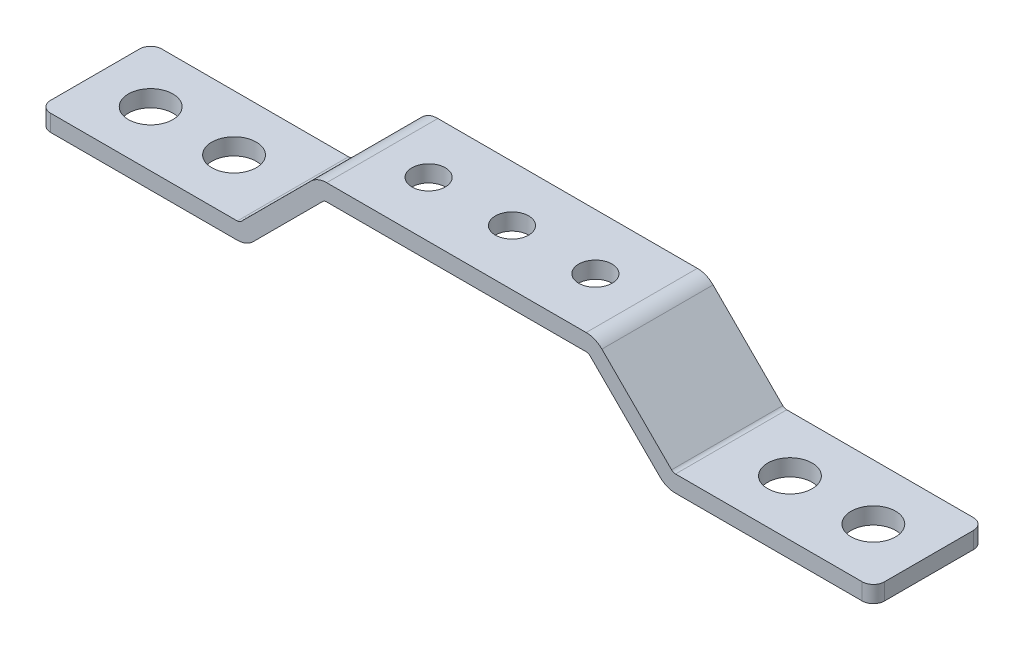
ISO-10303-21;
HEADER;
FILE_DESCRIPTION(('STEP AP214'),'2;1');
FILE_NAME('part.step','',(''),(''),'','','');
FILE_SCHEMA(('AUTOMOTIVE_DESIGN { 1 0 10303 214 1 1 1 1 }'));
ENDSEC;
DATA;
#1=APPLICATION_CONTEXT('core data for automotive mechanical design processes');
#2=APPLICATION_PROTOCOL_DEFINITION('international standard','automotive_design',2000,#1);
#3=PRODUCT_CONTEXT('',#1,'mechanical');
#4=PRODUCT('Part','Part','',(#3));
#5=PRODUCT_RELATED_PRODUCT_CATEGORY('part','',(#4));
#6=PRODUCT_DEFINITION_FORMATION('','',#4);
#7=PRODUCT_DEFINITION_CONTEXT('part definition',#1,'design');
#8=PRODUCT_DEFINITION('design','',#6,#7);
#9=PRODUCT_DEFINITION_SHAPE('','',#8);
#10=(LENGTH_UNIT() NAMED_UNIT(*) SI_UNIT(.MILLI.,.METRE.));
#11=(NAMED_UNIT(*) PLANE_ANGLE_UNIT() SI_UNIT($,.RADIAN.));
#12=(NAMED_UNIT(*) SI_UNIT($,.STERADIAN.) SOLID_ANGLE_UNIT());
#13=UNCERTAINTY_MEASURE_WITH_UNIT(LENGTH_MEASURE(1.E-05),#10,'distance_accuracy_value','');
#14=(GEOMETRIC_REPRESENTATION_CONTEXT(3) GLOBAL_UNCERTAINTY_ASSIGNED_CONTEXT((#13)) GLOBAL_UNIT_ASSIGNED_CONTEXT((#10,
#11,#12)) REPRESENTATION_CONTEXT('',''));
#15=CARTESIAN_POINT('',(0.,0.,0.));
#16=DIRECTION('',(0.,0.,1.));
#17=DIRECTION('',(1.,0.,0.));
#18=AXIS2_PLACEMENT_3D('',#15,#16,#17);
#19=CARTESIAN_POINT('',(39.4142135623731,-17.,10.));
#20=DIRECTION('',(0.,-1.,0.));
#21=DIRECTION('',(1.,0.,0.));
#22=AXIS2_PLACEMENT_3D('',#19,#20,#21);
#23=PLANE('',#22);
#24=CARTESIAN_POINT('',(65.,-17.,0.));
#25=DIRECTION('',(0.,1.,0.));
#26=DIRECTION('',(-1.,0.,0.));
#27=AXIS2_PLACEMENT_3D('',#24,#25,#26);
#28=CIRCLE('',#27,3.99999999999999);
#29=CARTESIAN_POINT('',(61.,-17.,0.));
#30=VERTEX_POINT('',#29);
#31=EDGE_CURVE('E654',#30,#30,#28,.T.);
#32=ORIENTED_EDGE('',*,*,#31,.T.);
#33=EDGE_LOOP('',(#32));
#34=FACE_BOUND('',#33,.T.);
#35=DIRECTION('',(0.,0.,-1.));
#36=VECTOR('',#35,1.);
#37=CARTESIAN_POINT('',(75.,-17.,10.));
#38=LINE('',#37,#36);
#39=CARTESIAN_POINT('',(75.,-17.,8.));
#40=VERTEX_POINT('',#39);
#41=CARTESIAN_POINT('',(75.,-17.,-8.));
#42=VERTEX_POINT('',#41);
#43=EDGE_CURVE('E332',#40,#42,#38,.T.);
#44=ORIENTED_EDGE('',*,*,#43,.F.);
#45=CARTESIAN_POINT('',(73.,-17.,8.));
#46=DIRECTION('',(0.,-1.,0.));
#47=DIRECTION('',(1.,0.,0.));
#48=AXIS2_PLACEMENT_3D('',#45,#46,#47);
#49=CIRCLE('',#48,2.);
#50=CARTESIAN_POINT('',(73.,-17.,10.));
#51=VERTEX_POINT('',#50);
#52=EDGE_CURVE('E11',#40,#51,#49,.T.);
#53=ORIENTED_EDGE('',*,*,#52,.T.);
#54=DIRECTION('',(-1.,0.,0.));
#55=VECTOR('',#54,1.);
#56=CARTESIAN_POINT('',(39.4142135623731,-17.,10.));
#57=LINE('',#56,#55);
#58=CARTESIAN_POINT('',(39.4142135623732,-17.,10.));
#59=VERTEX_POINT('',#58);
#60=EDGE_CURVE('E285',#51,#59,#57,.T.);
#61=ORIENTED_EDGE('',*,*,#60,.T.);
#62=DIRECTION('',(0.,0.,-1.));
#63=VECTOR('',#62,1.);
#64=CARTESIAN_POINT('',(39.4142135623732,-17.,10.));
#65=LINE('',#64,#63);
#66=CARTESIAN_POINT('',(39.4142135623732,-17.,-10.));
#67=VERTEX_POINT('',#66);
#68=EDGE_CURVE('E329',#59,#67,#65,.T.);
#69=ORIENTED_EDGE('',*,*,#68,.T.);
#70=DIRECTION('',(-1.,0.,0.));
#71=VECTOR('',#70,1.);
#72=CARTESIAN_POINT('',(39.4142135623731,-17.,-10.));
#73=LINE('',#72,#71);
#74=CARTESIAN_POINT('',(73.,-17.,-10.));
#75=VERTEX_POINT('',#74);
#76=EDGE_CURVE('E243',#75,#67,#73,.T.);
#77=ORIENTED_EDGE('',*,*,#76,.F.);
#78=CARTESIAN_POINT('',(73.,-17.,-8.));
#79=DIRECTION('',(0.,-1.,0.));
#80=DIRECTION('',(1.,0.,0.));
#81=AXIS2_PLACEMENT_3D('',#78,#79,#80);
#82=CIRCLE('',#81,2.);
#83=EDGE_CURVE('E41',#75,#42,#82,.T.);
#84=ORIENTED_EDGE('',*,*,#83,.T.);
#85=EDGE_LOOP('',(#44,#53,#61,#69,#77,#84));
#86=FACE_BOUND('',#85,.T.);
#87=CARTESIAN_POINT('',(50.,-17.,0.));
#88=DIRECTION('',(0.,-1.,0.));
#89=DIRECTION('',(1.,0.,0.));
#90=AXIS2_PLACEMENT_3D('',#87,#88,#89);
#91=CIRCLE('',#90,4.);
#92=CARTESIAN_POINT('',(46.,-17.,0.));
#93=VERTEX_POINT('',#92);
#94=EDGE_CURVE('E664',#93,#93,#91,.T.);
#95=ORIENTED_EDGE('',*,*,#94,.F.);
#96=EDGE_LOOP('',(#95));
#97=FACE_BOUND('',#96,.T.);
#98=ADVANCED_FACE('F33',(#34,#86,#97),#23,.T.);
#99=CARTESIAN_POINT('',(39.4142135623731,-14.,10.));
#100=DIRECTION('',(0.,-1.,0.));
#101=DIRECTION('',(1.,0.,0.));
#102=AXIS2_PLACEMENT_3D('',#99,#100,#101);
#103=PLANE('',#102);
#104=CARTESIAN_POINT('',(65.,-13.9999999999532,0.));
#105=DIRECTION('',(0.,1.,0.));
#106=DIRECTION('',(-1.,0.,0.));
#107=AXIS2_PLACEMENT_3D('',#104,#105,#106);
#108=CIRCLE('',#107,3.99999999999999);
#109=CARTESIAN_POINT('',(61.,-13.9999999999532,0.));
#110=VERTEX_POINT('',#109);
#111=EDGE_CURVE('E657',#110,#110,#108,.T.);
#112=ORIENTED_EDGE('',*,*,#111,.F.);
#113=EDGE_LOOP('',(#112));
#114=FACE_BOUND('',#113,.T.);
#115=DIRECTION('',(-1.,0.,0.));
#116=VECTOR('',#115,1.);
#117=CARTESIAN_POINT('',(39.4142135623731,-14.,10.));
#118=LINE('',#117,#116);
#119=CARTESIAN_POINT('',(73.,-14.,10.));
#120=VERTEX_POINT('',#119);
#121=CARTESIAN_POINT('',(39.4142135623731,-14.,10.));
#122=VERTEX_POINT('',#121);
#123=EDGE_CURVE('E283',#120,#122,#118,.T.);
#124=ORIENTED_EDGE('',*,*,#123,.F.);
#125=CARTESIAN_POINT('',(73.,-14.,8.));
#126=DIRECTION('',(0.,-1.,0.));
#127=DIRECTION('',(1.,0.,0.));
#128=AXIS2_PLACEMENT_3D('',#125,#126,#127);
#129=CIRCLE('',#128,2.);
#130=CARTESIAN_POINT('',(75.,-14.,8.));
#131=VERTEX_POINT('',#130);
#132=EDGE_CURVE('E380',#120,#131,#129,.F.);
#133=ORIENTED_EDGE('',*,*,#132,.T.);
#134=DIRECTION('',(0.,0.,-1.));
#135=VECTOR('',#134,1.);
#136=CARTESIAN_POINT('',(75.,-14.,10.));
#137=LINE('',#136,#135);
#138=CARTESIAN_POINT('',(75.,-14.,-8.));
#139=VERTEX_POINT('',#138);
#140=EDGE_CURVE('E334',#131,#139,#137,.T.);
#141=ORIENTED_EDGE('',*,*,#140,.T.);
#142=CARTESIAN_POINT('',(73.,-14.,-8.));
#143=DIRECTION('',(0.,-1.,0.));
#144=DIRECTION('',(1.,0.,0.));
#145=AXIS2_PLACEMENT_3D('',#142,#143,#144);
#146=CIRCLE('',#145,2.);
#147=CARTESIAN_POINT('',(73.,-14.,-10.));
#148=VERTEX_POINT('',#147);
#149=EDGE_CURVE('E378',#139,#148,#146,.F.);
#150=ORIENTED_EDGE('',*,*,#149,.T.);
#151=DIRECTION('',(-1.,0.,0.));
#152=VECTOR('',#151,1.);
#153=CARTESIAN_POINT('',(39.4142135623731,-14.,-10.));
#154=LINE('',#153,#152);
#155=CARTESIAN_POINT('',(39.4142135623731,-14.,-10.));
#156=VERTEX_POINT('',#155);
#157=EDGE_CURVE('E241',#148,#156,#154,.T.);
#158=ORIENTED_EDGE('',*,*,#157,.T.);
#159=DIRECTION('',(0.,0.,-1.));
#160=VECTOR('',#159,1.);
#161=CARTESIAN_POINT('',(39.4142135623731,-14.,10.));
#162=LINE('',#161,#160);
#163=EDGE_CURVE('E337',#122,#156,#162,.T.);
#164=ORIENTED_EDGE('',*,*,#163,.F.);
#165=EDGE_LOOP('',(#124,#133,#141,#150,#158,#164));
#166=FACE_BOUND('',#165,.T.);
#167=CARTESIAN_POINT('',(50.,-13.9999999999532,0.));
#168=DIRECTION('',(0.,-1.,0.));
#169=DIRECTION('',(1.,0.,0.));
#170=AXIS2_PLACEMENT_3D('',#167,#168,#169);
#171=CIRCLE('',#170,4.);
#172=CARTESIAN_POINT('',(46.,-13.9999999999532,0.));
#173=VERTEX_POINT('',#172);
#174=EDGE_CURVE('E659',#173,#173,#171,.T.);
#175=ORIENTED_EDGE('',*,*,#174,.T.);
#176=EDGE_LOOP('',(#175));
#177=FACE_BOUND('',#176,.T.);
#178=ADVANCED_FACE('F390',(#114,#166,#177),#103,.F.);
#179=CARTESIAN_POINT('',(-39.4142135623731,-17.,10.));
#180=DIRECTION('',(0.,-1.,0.));
#181=DIRECTION('',(1.,0.,0.));
#182=AXIS2_PLACEMENT_3D('',#179,#180,#181);
#183=PLANE('',#182);
#184=DIRECTION('',(-1.,0.,0.));
#185=VECTOR('',#184,1.);
#186=CARTESIAN_POINT('',(-39.4142135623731,-17.,10.));
#187=LINE('',#186,#185);
#188=CARTESIAN_POINT('',(-39.4142135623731,-17.,10.));
#189=VERTEX_POINT('',#188);
#190=CARTESIAN_POINT('',(-73.,-17.,10.));
#191=VERTEX_POINT('',#190);
#192=EDGE_CURVE('E308',#189,#191,#187,.T.);
#193=ORIENTED_EDGE('',*,*,#192,.T.);
#194=CARTESIAN_POINT('',(-73.,-17.,8.));
#195=DIRECTION('',(0.,-1.,0.));
#196=DIRECTION('',(1.,0.,0.));
#197=AXIS2_PLACEMENT_3D('',#194,#195,#196);
#198=CIRCLE('',#197,2.);
#199=CARTESIAN_POINT('',(-75.,-17.,8.));
#200=VERTEX_POINT('',#199);
#201=EDGE_CURVE('E373',#191,#200,#198,.T.);
#202=ORIENTED_EDGE('',*,*,#201,.T.);
#203=DIRECTION('',(0.,0.,-1.));
#204=VECTOR('',#203,1.);
#205=CARTESIAN_POINT('',(-75.,-17.,10.));
#206=LINE('',#205,#204);
#207=CARTESIAN_POINT('',(-75.,-17.,-8.));
#208=VERTEX_POINT('',#207);
#209=EDGE_CURVE('E311',#200,#208,#206,.T.);
#210=ORIENTED_EDGE('',*,*,#209,.T.);
#211=CARTESIAN_POINT('',(-73.,-17.,-8.));
#212=DIRECTION('',(0.,-1.,0.));
#213=DIRECTION('',(1.,0.,0.));
#214=AXIS2_PLACEMENT_3D('',#211,#212,#213);
#215=CIRCLE('',#214,2.);
#216=CARTESIAN_POINT('',(-73.,-17.,-10.));
#217=VERTEX_POINT('',#216);
#218=EDGE_CURVE('E371',#208,#217,#215,.T.);
#219=ORIENTED_EDGE('',*,*,#218,.T.);
#220=DIRECTION('',(-1.,0.,0.));
#221=VECTOR('',#220,1.);
#222=CARTESIAN_POINT('',(-39.4142135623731,-17.,-10.));
#223=LINE('',#222,#221);
#224=CARTESIAN_POINT('',(-39.4142135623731,-17.,-10.));
#225=VERTEX_POINT('',#224);
#226=EDGE_CURVE('E266',#225,#217,#223,.T.);
#227=ORIENTED_EDGE('',*,*,#226,.F.);
#228=DIRECTION('',(0.,0.,-1.));
#229=VECTOR('',#228,1.);
#230=CARTESIAN_POINT('',(-39.4142135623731,-17.,10.));
#231=LINE('',#230,#229);
#232=EDGE_CURVE('E315',#189,#225,#231,.T.);
#233=ORIENTED_EDGE('',*,*,#232,.F.);
#234=EDGE_LOOP('',(#193,#202,#210,#219,#227,#233));
#235=FACE_BOUND('',#234,.T.);
#236=CARTESIAN_POINT('',(-50.,-17.,0.));
#237=DIRECTION('',(0.,1.,0.));
#238=DIRECTION('',(-1.,0.,0.));
#239=AXIS2_PLACEMENT_3D('',#236,#237,#238);
#240=CIRCLE('',#239,4.);
#241=CARTESIAN_POINT('',(-54.,-17.,0.));
#242=VERTEX_POINT('',#241);
#243=EDGE_CURVE('E551',#242,#242,#240,.T.);
#244=ORIENTED_EDGE('',*,*,#243,.T.);
#245=EDGE_LOOP('',(#244));
#246=FACE_BOUND('',#245,.T.);
#247=CARTESIAN_POINT('',(-65.,-17.,0.));
#248=DIRECTION('',(0.,-1.,0.));
#249=DIRECTION('',(1.,0.,0.));
#250=AXIS2_PLACEMENT_3D('',#247,#248,#249);
#251=CIRCLE('',#250,3.99999999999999);
#252=CARTESIAN_POINT('',(-69.,-17.,0.));
#253=VERTEX_POINT('',#252);
#254=EDGE_CURVE('E670',#253,#253,#251,.T.);
#255=ORIENTED_EDGE('',*,*,#254,.F.);
#256=EDGE_LOOP('',(#255));
#257=FACE_BOUND('',#256,.T.);
#258=ADVANCED_FACE('F429',(#235,#246,#257),#183,.T.);
#259=CARTESIAN_POINT('',(-39.4142135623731,-14.,10.));
#260=DIRECTION('',(0.,-1.,0.));
#261=DIRECTION('',(1.,0.,0.));
#262=AXIS2_PLACEMENT_3D('',#259,#260,#261);
#263=PLANE('',#262);
#264=DIRECTION('',(0.,0.,-1.));
#265=VECTOR('',#264,1.);
#266=CARTESIAN_POINT('',(-75.,-14.,10.));
#267=LINE('',#266,#265);
#268=CARTESIAN_POINT('',(-75.,-14.,8.));
#269=VERTEX_POINT('',#268);
#270=CARTESIAN_POINT('',(-75.,-14.,-8.));
#271=VERTEX_POINT('',#270);
#272=EDGE_CURVE('E216',#269,#271,#267,.T.);
#273=ORIENTED_EDGE('',*,*,#272,.F.);
#274=CARTESIAN_POINT('',(-73.,-14.,8.));
#275=DIRECTION('',(0.,-1.,0.));
#276=DIRECTION('',(1.,0.,0.));
#277=AXIS2_PLACEMENT_3D('',#274,#275,#276);
#278=CIRCLE('',#277,2.);
#279=CARTESIAN_POINT('',(-73.,-14.,10.));
#280=VERTEX_POINT('',#279);
#281=EDGE_CURVE('E364',#269,#280,#278,.F.);
#282=ORIENTED_EDGE('',*,*,#281,.T.);
#283=DIRECTION('',(-1.,0.,0.));
#284=VECTOR('',#283,1.);
#285=CARTESIAN_POINT('',(-39.4142135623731,-14.,10.));
#286=LINE('',#285,#284);
#287=CARTESIAN_POINT('',(-39.4142135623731,-14.,10.));
#288=VERTEX_POINT('',#287);
#289=EDGE_CURVE('E215',#288,#280,#286,.T.);
#290=ORIENTED_EDGE('',*,*,#289,.F.);
#291=DIRECTION('',(0.,0.,-1.));
#292=VECTOR('',#291,1.);
#293=CARTESIAN_POINT('',(-39.4142135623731,-14.,10.));
#294=LINE('',#293,#292);
#295=CARTESIAN_POINT('',(-39.4142135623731,-14.,-10.));
#296=VERTEX_POINT('',#295);
#297=EDGE_CURVE('E199',#288,#296,#294,.T.);
#298=ORIENTED_EDGE('',*,*,#297,.T.);
#299=DIRECTION('',(-1.,0.,0.));
#300=VECTOR('',#299,1.);
#301=CARTESIAN_POINT('',(-39.4142135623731,-14.,-10.));
#302=LINE('',#301,#300);
#303=CARTESIAN_POINT('',(-73.,-14.,-10.));
#304=VERTEX_POINT('',#303);
#305=EDGE_CURVE('E207',#296,#304,#302,.T.);
#306=ORIENTED_EDGE('',*,*,#305,.T.);
#307=CARTESIAN_POINT('',(-73.,-14.,-8.));
#308=DIRECTION('',(0.,-1.,0.));
#309=DIRECTION('',(1.,0.,0.));
#310=AXIS2_PLACEMENT_3D('',#307,#308,#309);
#311=CIRCLE('',#310,2.);
#312=EDGE_CURVE('E362',#304,#271,#311,.F.);
#313=ORIENTED_EDGE('',*,*,#312,.T.);
#314=EDGE_LOOP('',(#273,#282,#290,#298,#306,#313));
#315=FACE_BOUND('',#314,.T.);
#316=CARTESIAN_POINT('',(-50.,-13.9999999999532,0.));
#317=DIRECTION('',(0.,1.,0.));
#318=DIRECTION('',(-1.,0.,0.));
#319=AXIS2_PLACEMENT_3D('',#316,#317,#318);
#320=CIRCLE('',#319,4.);
#321=CARTESIAN_POINT('',(-54.,-13.9999999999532,0.));
#322=VERTEX_POINT('',#321);
#323=EDGE_CURVE('E556',#322,#322,#320,.T.);
#324=ORIENTED_EDGE('',*,*,#323,.F.);
#325=EDGE_LOOP('',(#324));
#326=FACE_BOUND('',#325,.T.);
#327=CARTESIAN_POINT('',(-65.,-13.9999999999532,0.));
#328=DIRECTION('',(0.,-1.,0.));
#329=DIRECTION('',(1.,0.,0.));
#330=AXIS2_PLACEMENT_3D('',#327,#328,#329);
#331=CIRCLE('',#330,3.99999999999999);
#332=CARTESIAN_POINT('',(-69.,-13.9999999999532,0.));
#333=VERTEX_POINT('',#332);
#334=EDGE_CURVE('E667',#333,#333,#331,.T.);
#335=ORIENTED_EDGE('',*,*,#334,.T.);
#336=EDGE_LOOP('',(#335));
#337=FACE_BOUND('',#336,.T.);
#338=ADVANCED_FACE('F212',(#315,#326,#337),#263,.F.);
#339=CARTESIAN_POINT('',(-23.3431457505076,-3.,10.));
#340=DIRECTION('',(0.,-1.,0.));
#341=DIRECTION('',(0.,0.,-1.));
#342=AXIS2_PLACEMENT_3D('',#339,#340,#341);
#343=PLANE('',#342);
#344=DIRECTION('',(1.,0.,0.));
#345=VECTOR('',#344,1.);
#346=CARTESIAN_POINT('',(-23.3431457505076,-3.,-10.));
#347=LINE('',#346,#345);
#348=CARTESIAN_POINT('',(23.3431457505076,-3.,-10.));
#349=VERTEX_POINT('',#348);
#350=CARTESIAN_POINT('',(-23.3431457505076,-3.,-10.));
#351=VERTEX_POINT('',#350);
#352=EDGE_CURVE('E254',#349,#351,#347,.F.);
#353=ORIENTED_EDGE('',*,*,#352,.F.);
#354=DIRECTION('',(0.,0.,-1.));
#355=VECTOR('',#354,1.);
#356=CARTESIAN_POINT('',(23.3431457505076,-3.,10.));
#357=LINE('',#356,#355);
#358=CARTESIAN_POINT('',(23.3431457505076,-3.,10.));
#359=VERTEX_POINT('',#358);
#360=EDGE_CURVE('E323',#359,#349,#357,.T.);
#361=ORIENTED_EDGE('',*,*,#360,.F.);
#362=DIRECTION('',(1.,0.,0.));
#363=VECTOR('',#362,1.);
#364=CARTESIAN_POINT('',(-23.3431457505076,-3.,10.));
#365=LINE('',#364,#363);
#366=CARTESIAN_POINT('',(-23.3431457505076,-3.,10.));
#367=VERTEX_POINT('',#366);
#368=EDGE_CURVE('E296',#359,#367,#365,.F.);
#369=ORIENTED_EDGE('',*,*,#368,.T.);
#370=DIRECTION('',(0.,0.,-1.));
#371=VECTOR('',#370,1.);
#372=CARTESIAN_POINT('',(-23.3431457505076,-3.,10.));
#373=LINE('',#372,#371);
#374=EDGE_CURVE('E321',#367,#351,#373,.T.);
#375=ORIENTED_EDGE('',*,*,#374,.T.);
#376=EDGE_LOOP('',(#353,#361,#369,#375));
#377=FACE_BOUND('',#376,.T.);
#378=CARTESIAN_POINT('',(0.,-3.,0.));
#379=DIRECTION('',(0.,-1.,0.));
#380=DIRECTION('',(0.,0.,-1.));
#381=AXIS2_PLACEMENT_3D('',#378,#379,#380);
#382=CIRCLE('',#381,3.);
#383=CARTESIAN_POINT('',(0.,-3.,-3.));
#384=VERTEX_POINT('',#383);
#385=EDGE_CURVE('E223',#384,#384,#382,.T.);
#386=ORIENTED_EDGE('',*,*,#385,.F.);
#387=EDGE_LOOP('',(#386));
#388=FACE_BOUND('',#387,.T.);
#389=CARTESIAN_POINT('',(15.,-3.,0.));
#390=DIRECTION('',(0.,-1.,0.));
#391=DIRECTION('',(0.,0.,-1.));
#392=AXIS2_PLACEMENT_3D('',#389,#390,#391);
#393=CIRCLE('',#392,3.);
#394=CARTESIAN_POINT('',(15.,-3.,-3.));
#395=VERTEX_POINT('',#394);
#396=EDGE_CURVE('E561',#395,#395,#393,.T.);
#397=ORIENTED_EDGE('',*,*,#396,.F.);
#398=EDGE_LOOP('',(#397));
#399=FACE_BOUND('',#398,.T.);
#400=CARTESIAN_POINT('',(-15.,-3.,0.));
#401=DIRECTION('',(0.,-1.,0.));
#402=DIRECTION('',(0.,0.,-1.));
#403=AXIS2_PLACEMENT_3D('',#400,#401,#402);
#404=CIRCLE('',#403,3.);
#405=CARTESIAN_POINT('',(-15.,-3.,-3.));
#406=VERTEX_POINT('',#405);
#407=EDGE_CURVE('E550',#406,#406,#404,.F.);
#408=ORIENTED_EDGE('',*,*,#407,.T.);
#409=EDGE_LOOP('',(#408));
#410=FACE_BOUND('',#409,.T.);
#411=ADVANCED_FACE('F454',(#377,#388,#399,#410),#343,.T.);
#412=CARTESIAN_POINT('',(-23.3431457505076,0.,10.));
#413=DIRECTION('',(0.,-1.,0.));
#414=DIRECTION('',(0.,0.,-1.));
#415=AXIS2_PLACEMENT_3D('',#412,#413,#414);
#416=PLANE('',#415);
#417=DIRECTION('',(-1.,0.,0.));
#418=VECTOR('',#417,1.);
#419=CARTESIAN_POINT('',(-23.3431457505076,0.,-10.));
#420=LINE('',#419,#418);
#421=CARTESIAN_POINT('',(23.3431457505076,0.,-10.));
#422=VERTEX_POINT('',#421);
#423=CARTESIAN_POINT('',(-23.3431457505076,0.,-10.));
#424=VERTEX_POINT('',#423);
#425=EDGE_CURVE('E233',#422,#424,#420,.T.);
#426=ORIENTED_EDGE('',*,*,#425,.T.);
#427=DIRECTION('',(0.,0.,-1.));
#428=VECTOR('',#427,1.);
#429=CARTESIAN_POINT('',(-23.3431457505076,0.,10.));
#430=LINE('',#429,#428);
#431=CARTESIAN_POINT('',(-23.3431457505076,0.,10.));
#432=VERTEX_POINT('',#431);
#433=EDGE_CURVE('E349',#432,#424,#430,.T.);
#434=ORIENTED_EDGE('',*,*,#433,.F.);
#435=DIRECTION('',(-1.,0.,0.));
#436=VECTOR('',#435,1.);
#437=CARTESIAN_POINT('',(-23.3431457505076,0.,10.));
#438=LINE('',#437,#436);
#439=CARTESIAN_POINT('',(23.3431457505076,0.,10.));
#440=VERTEX_POINT('',#439);
#441=EDGE_CURVE('E275',#440,#432,#438,.T.);
#442=ORIENTED_EDGE('',*,*,#441,.F.);
#443=DIRECTION('',(0.,0.,-1.));
#444=VECTOR('',#443,1.);
#445=CARTESIAN_POINT('',(23.3431457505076,0.,10.));
#446=LINE('',#445,#444);
#447=EDGE_CURVE('E346',#440,#422,#446,.T.);
#448=ORIENTED_EDGE('',*,*,#447,.T.);
#449=EDGE_LOOP('',(#426,#434,#442,#448));
#450=FACE_BOUND('',#449,.T.);
#451=CARTESIAN_POINT('',(0.,0.,0.));
#452=DIRECTION('',(0.,1.,0.));
#453=DIRECTION('',(0.,0.,1.));
#454=AXIS2_PLACEMENT_3D('',#451,#452,#453);
#455=CIRCLE('',#454,3.);
#456=CARTESIAN_POINT('',(0.,0.,3.));
#457=VERTEX_POINT('',#456);
#458=EDGE_CURVE('E226',#457,#457,#455,.T.);
#459=ORIENTED_EDGE('',*,*,#458,.F.);
#460=EDGE_LOOP('',(#459));
#461=FACE_BOUND('',#460,.T.);
#462=CARTESIAN_POINT('',(15.,0.,0.));
#463=DIRECTION('',(0.,1.,0.));
#464=DIRECTION('',(0.,0.,1.));
#465=AXIS2_PLACEMENT_3D('',#462,#463,#464);
#466=CIRCLE('',#465,3.);
#467=CARTESIAN_POINT('',(15.,0.,3.));
#468=VERTEX_POINT('',#467);
#469=EDGE_CURVE('E545',#468,#468,#466,.T.);
#470=ORIENTED_EDGE('',*,*,#469,.F.);
#471=EDGE_LOOP('',(#470));
#472=FACE_BOUND('',#471,.T.);
#473=CARTESIAN_POINT('',(-15.,0.,0.));
#474=DIRECTION('',(0.,-1.,0.));
#475=DIRECTION('',(0.,0.,-1.));
#476=AXIS2_PLACEMENT_3D('',#473,#474,#475);
#477=CIRCLE('',#476,3.);
#478=CARTESIAN_POINT('',(-15.,0.,-3.));
#479=VERTEX_POINT('',#478);
#480=EDGE_CURVE('E548',#479,#479,#477,.T.);
#481=ORIENTED_EDGE('',*,*,#480,.T.);
#482=EDGE_LOOP('',(#481));
#483=FACE_BOUND('',#482,.T.);
#484=ADVANCED_FACE('F451',(#450,#461,#472,#483),#416,.F.);
#485=CARTESIAN_POINT('',(-75.,-17.,10.));
#486=DIRECTION('',(-1.,0.,0.));
#487=DIRECTION('',(0.,0.,1.));
#488=AXIS2_PLACEMENT_3D('',#485,#486,#487);
#489=PLANE('',#488);
#490=ORIENTED_EDGE('',*,*,#209,.F.);
#491=DIRECTION('',(0.,1.,0.));
#492=VECTOR('',#491,1.);
#493=CARTESIAN_POINT('',(-75.,-14.,8.));
#494=LINE('',#493,#492);
#495=EDGE_CURVE('E359',#200,#269,#494,.T.);
#496=ORIENTED_EDGE('',*,*,#495,.T.);
#497=ORIENTED_EDGE('',*,*,#272,.T.);
#498=DIRECTION('',(0.,1.,0.));
#499=VECTOR('',#498,1.);
#500=CARTESIAN_POINT('',(-75.,-17.,-8.));
#501=LINE('',#500,#499);
#502=EDGE_CURVE('E314',#271,#208,#501,.F.);
#503=ORIENTED_EDGE('',*,*,#502,.T.);
#504=EDGE_LOOP('',(#490,#496,#497,#503));
#505=FACE_BOUND('',#504,.T.);
#506=ADVANCED_FACE('F35',(#505),#489,.T.);
#507=CARTESIAN_POINT('',(-39.414213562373,-13.,10.));
#508=DIRECTION('',(0.,0.,-1.));
#509=DIRECTION('',(-1.,0.,0.));
#510=AXIS2_PLACEMENT_3D('',#507,#508,#509);
#511=CYLINDRICAL_SURFACE('',#510,3.99999999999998);
#512=CARTESIAN_POINT('',(-39.414213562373,-13.,-10.));
#513=DIRECTION('',(0.,0.,1.));
#514=DIRECTION('',(1.,0.,0.));
#515=AXIS2_PLACEMENT_3D('',#512,#513,#514);
#516=CIRCLE('',#515,3.99999999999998);
#517=CARTESIAN_POINT('',(-36.585786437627,-15.8284271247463,-10.));
#518=VERTEX_POINT('',#517);
#519=EDGE_CURVE('E263',#518,#225,#516,.F.);
#520=ORIENTED_EDGE('',*,*,#519,.F.);
#521=DIRECTION('',(0.,0.,-1.));
#522=VECTOR('',#521,1.);
#523=CARTESIAN_POINT('',(-36.585786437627,-15.8284271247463,10.));
#524=LINE('',#523,#522);
#525=CARTESIAN_POINT('',(-36.585786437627,-15.8284271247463,10.));
#526=VERTEX_POINT('',#525);
#527=EDGE_CURVE('E317',#526,#518,#524,.T.);
#528=ORIENTED_EDGE('',*,*,#527,.F.);
#529=CARTESIAN_POINT('',(-39.414213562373,-13.,10.));
#530=DIRECTION('',(0.,0.,1.));
#531=DIRECTION('',(1.,0.,0.));
#532=AXIS2_PLACEMENT_3D('',#529,#530,#531);
#533=CIRCLE('',#532,3.99999999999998);
#534=EDGE_CURVE('E305',#526,#189,#533,.F.);
#535=ORIENTED_EDGE('',*,*,#534,.T.);
#536=ORIENTED_EDGE('',*,*,#232,.T.);
#537=EDGE_LOOP('',(#520,#528,#535,#536));
#538=FACE_BOUND('',#537,.T.);
#539=ADVANCED_FACE('F479',(#538),#511,.T.);
#540=CARTESIAN_POINT('',(-24.0502525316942,-3.29289321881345,10.));
#541=DIRECTION('',(0.707106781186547,-0.707106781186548,0.));
#542=DIRECTION('',(0.707106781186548,0.707106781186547,0.));
#543=AXIS2_PLACEMENT_3D('',#540,#541,#542);
#544=PLANE('',#543);
#545=DIRECTION('',(-0.707106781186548,-0.707106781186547,0.));
#546=VECTOR('',#545,1.);
#547=CARTESIAN_POINT('',(-24.0502525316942,-3.29289321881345,-10.));
#548=LINE('',#547,#546);
#549=CARTESIAN_POINT('',(-24.0502525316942,-3.29289321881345,-10.));
#550=VERTEX_POINT('',#549);
#551=EDGE_CURVE('E260',#550,#518,#548,.T.);
#552=ORIENTED_EDGE('',*,*,#551,.F.);
#553=DIRECTION('',(0.,0.,-1.));
#554=VECTOR('',#553,1.);
#555=CARTESIAN_POINT('',(-24.0502525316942,-3.29289321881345,10.));
#556=LINE('',#555,#554);
#557=CARTESIAN_POINT('',(-24.0502525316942,-3.29289321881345,10.));
#558=VERTEX_POINT('',#557);
#559=EDGE_CURVE('E319',#558,#550,#556,.T.);
#560=ORIENTED_EDGE('',*,*,#559,.F.);
#561=DIRECTION('',(-0.707106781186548,-0.707106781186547,0.));
#562=VECTOR('',#561,1.);
#563=CARTESIAN_POINT('',(-24.0502525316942,-3.29289321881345,10.));
#564=LINE('',#563,#562);
#565=EDGE_CURVE('E302',#558,#526,#564,.T.);
#566=ORIENTED_EDGE('',*,*,#565,.T.);
#567=ORIENTED_EDGE('',*,*,#527,.T.);
#568=EDGE_LOOP('',(#552,#560,#566,#567));
#569=FACE_BOUND('',#568,.T.);
#570=ADVANCED_FACE('F482',(#569),#544,.T.);
#571=CARTESIAN_POINT('',(-23.3431457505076,-4.,10.));
#572=DIRECTION('',(0.,0.,-1.));
#573=DIRECTION('',(-1.,0.,0.));
#574=AXIS2_PLACEMENT_3D('',#571,#572,#573);
#575=CYLINDRICAL_SURFACE('',#574,1.);
#576=CARTESIAN_POINT('',(-23.3431457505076,-4.,-10.));
#577=DIRECTION('',(0.,0.,1.));
#578=DIRECTION('',(1.,0.,0.));
#579=AXIS2_PLACEMENT_3D('',#576,#577,#578);
#580=CIRCLE('',#579,1.);
#581=EDGE_CURVE('E257',#351,#550,#580,.T.);
#582=ORIENTED_EDGE('',*,*,#581,.F.);
#583=ORIENTED_EDGE('',*,*,#374,.F.);
#584=CARTESIAN_POINT('',(-23.3431457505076,-4.,10.));
#585=DIRECTION('',(0.,0.,1.));
#586=DIRECTION('',(1.,0.,0.));
#587=AXIS2_PLACEMENT_3D('',#584,#585,#586);
#588=CIRCLE('',#587,1.);
#589=EDGE_CURVE('E299',#367,#558,#588,.T.);
#590=ORIENTED_EDGE('',*,*,#589,.T.);
#591=ORIENTED_EDGE('',*,*,#559,.T.);
#592=EDGE_LOOP('',(#582,#583,#590,#591));
#593=FACE_BOUND('',#592,.T.);
#594=ADVANCED_FACE('F486',(#593),#575,.F.);
#595=CARTESIAN_POINT('',(23.3431457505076,-4.,10.));
#596=DIRECTION('',(0.,0.,-1.));
#597=DIRECTION('',(-1.,0.,0.));
#598=AXIS2_PLACEMENT_3D('',#595,#596,#597);
#599=CYLINDRICAL_SURFACE('',#598,1.);
#600=CARTESIAN_POINT('',(23.3431457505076,-4.,-10.));
#601=DIRECTION('',(0.,0.,1.));
#602=DIRECTION('',(1.,0.,0.));
#603=AXIS2_PLACEMENT_3D('',#600,#601,#602);
#604=CIRCLE('',#603,1.);
#605=CARTESIAN_POINT('',(24.0502525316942,-3.29289321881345,-10.));
#606=VERTEX_POINT('',#605);
#607=EDGE_CURVE('E251',#606,#349,#604,.T.);
#608=ORIENTED_EDGE('',*,*,#607,.F.);
#609=DIRECTION('',(0.,0.,-1.));
#610=VECTOR('',#609,1.);
#611=CARTESIAN_POINT('',(24.0502525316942,-3.29289321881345,10.));
#612=LINE('',#611,#610);
#613=CARTESIAN_POINT('',(24.0502525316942,-3.29289321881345,10.));
#614=VERTEX_POINT('',#613);
#615=EDGE_CURVE('E325',#614,#606,#612,.T.);
#616=ORIENTED_EDGE('',*,*,#615,.F.);
#617=CARTESIAN_POINT('',(23.3431457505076,-4.,10.));
#618=DIRECTION('',(0.,0.,1.));
#619=DIRECTION('',(1.,0.,0.));
#620=AXIS2_PLACEMENT_3D('',#617,#618,#619);
#621=CIRCLE('',#620,1.);
#622=EDGE_CURVE('E293',#614,#359,#621,.T.);
#623=ORIENTED_EDGE('',*,*,#622,.T.);
#624=ORIENTED_EDGE('',*,*,#360,.T.);
#625=EDGE_LOOP('',(#608,#616,#623,#624));
#626=FACE_BOUND('',#625,.T.);
#627=ADVANCED_FACE('F489',(#626),#599,.F.);
#628=CARTESIAN_POINT('',(24.0502525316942,-3.29289321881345,10.));
#629=DIRECTION('',(-0.707106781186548,-0.707106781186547,0.));
#630=DIRECTION('',(0.707106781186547,-0.707106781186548,0.));
#631=AXIS2_PLACEMENT_3D('',#628,#629,#630);
#632=PLANE('',#631);
#633=DIRECTION('',(-0.707106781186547,0.707106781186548,0.));
#634=VECTOR('',#633,1.);
#635=CARTESIAN_POINT('',(24.0502525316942,-3.29289321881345,-10.));
#636=LINE('',#635,#634);
#637=CARTESIAN_POINT('',(36.5857864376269,-15.8284271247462,-10.));
#638=VERTEX_POINT('',#637);
#639=EDGE_CURVE('E248',#638,#606,#636,.T.);
#640=ORIENTED_EDGE('',*,*,#639,.F.);
#641=DIRECTION('',(0.,0.,-1.));
#642=VECTOR('',#641,1.);
#643=CARTESIAN_POINT('',(36.5857864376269,-15.8284271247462,10.));
#644=LINE('',#643,#642);
#645=CARTESIAN_POINT('',(36.5857864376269,-15.8284271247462,10.));
#646=VERTEX_POINT('',#645);
#647=EDGE_CURVE('E327',#646,#638,#644,.T.);
#648=ORIENTED_EDGE('',*,*,#647,.F.);
#649=DIRECTION('',(-0.707106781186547,0.707106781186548,0.));
#650=VECTOR('',#649,1.);
#651=CARTESIAN_POINT('',(24.0502525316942,-3.29289321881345,10.));
#652=LINE('',#651,#650);
#653=EDGE_CURVE('E290',#646,#614,#652,.T.);
#654=ORIENTED_EDGE('',*,*,#653,.T.);
#655=ORIENTED_EDGE('',*,*,#615,.T.);
#656=EDGE_LOOP('',(#640,#648,#654,#655));
#657=FACE_BOUND('',#656,.T.);
#658=ADVANCED_FACE('F493',(#657),#632,.T.);
#659=CARTESIAN_POINT('',(39.414213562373,-13.,10.));
#660=DIRECTION('',(0.,0.,-1.));
#661=DIRECTION('',(-1.,0.,0.));
#662=AXIS2_PLACEMENT_3D('',#659,#660,#661);
#663=CYLINDRICAL_SURFACE('',#662,3.99999999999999);
#664=CARTESIAN_POINT('',(39.414213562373,-13.,-10.));
#665=DIRECTION('',(0.,0.,1.));
#666=DIRECTION('',(1.,0.,0.));
#667=AXIS2_PLACEMENT_3D('',#664,#665,#666);
#668=CIRCLE('',#667,3.99999999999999);
#669=EDGE_CURVE('E245',#67,#638,#668,.F.);
#670=ORIENTED_EDGE('',*,*,#669,.F.);
#671=ORIENTED_EDGE('',*,*,#68,.F.);
#672=CARTESIAN_POINT('',(39.414213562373,-13.,10.));
#673=DIRECTION('',(0.,0.,1.));
#674=DIRECTION('',(1.,0.,0.));
#675=AXIS2_PLACEMENT_3D('',#672,#673,#674);
#676=CIRCLE('',#675,3.99999999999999);
#677=EDGE_CURVE('E287',#59,#646,#676,.F.);
#678=ORIENTED_EDGE('',*,*,#677,.T.);
#679=ORIENTED_EDGE('',*,*,#647,.T.);
#680=EDGE_LOOP('',(#670,#671,#678,#679));
#681=FACE_BOUND('',#680,.T.);
#682=ADVANCED_FACE('F407',(#681),#663,.T.);
#683=CARTESIAN_POINT('',(75.,-17.,10.));
#684=DIRECTION('',(-1.,0.,0.));
#685=DIRECTION('',(0.,0.,1.));
#686=AXIS2_PLACEMENT_3D('',#683,#684,#685);
#687=PLANE('',#686);
#688=ORIENTED_EDGE('',*,*,#140,.F.);
#689=DIRECTION('',(0.,1.,0.));
#690=VECTOR('',#689,1.);
#691=CARTESIAN_POINT('',(75.,-17.,8.));
#692=LINE('',#691,#690);
#693=EDGE_CURVE('E54',#131,#40,#692,.F.);
#694=ORIENTED_EDGE('',*,*,#693,.T.);
#695=ORIENTED_EDGE('',*,*,#43,.T.);
#696=DIRECTION('',(0.,1.,0.));
#697=VECTOR('',#696,1.);
#698=CARTESIAN_POINT('',(75.,-14.,-8.));
#699=LINE('',#698,#697);
#700=EDGE_CURVE('E382',#42,#139,#699,.T.);
#701=ORIENTED_EDGE('',*,*,#700,.T.);
#702=EDGE_LOOP('',(#688,#694,#695,#701));
#703=FACE_BOUND('',#702,.T.);
#704=ADVANCED_FACE('F386',(#703),#687,.F.);
#705=CARTESIAN_POINT('',(39.414213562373,-13.,10.));
#706=DIRECTION('',(0.,0.,-1.));
#707=DIRECTION('',(-1.,0.,0.));
#708=AXIS2_PLACEMENT_3D('',#705,#706,#707);
#709=CYLINDRICAL_SURFACE('',#708,0.999999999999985);
#710=CARTESIAN_POINT('',(39.414213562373,-13.,-10.));
#711=DIRECTION('',(0.,0.,-1.));
#712=DIRECTION('',(1.,0.,0.));
#713=AXIS2_PLACEMENT_3D('',#710,#711,#712);
#714=CIRCLE('',#713,0.999999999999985);
#715=CARTESIAN_POINT('',(38.7071067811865,-13.7071067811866,-10.));
#716=VERTEX_POINT('',#715);
#717=EDGE_CURVE('E239',#156,#716,#714,.T.);
#718=ORIENTED_EDGE('',*,*,#717,.T.);
#719=DIRECTION('',(0.,0.,-1.));
#720=VECTOR('',#719,1.);
#721=CARTESIAN_POINT('',(38.7071067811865,-13.7071067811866,10.));
#722=LINE('',#721,#720);
#723=CARTESIAN_POINT('',(38.7071067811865,-13.7071067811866,10.));
#724=VERTEX_POINT('',#723);
#725=EDGE_CURVE('E340',#724,#716,#722,.T.);
#726=ORIENTED_EDGE('',*,*,#725,.F.);
#727=CARTESIAN_POINT('',(39.414213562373,-13.,10.));
#728=DIRECTION('',(0.,0.,-1.));
#729=DIRECTION('',(1.,0.,0.));
#730=AXIS2_PLACEMENT_3D('',#727,#728,#729);
#731=CIRCLE('',#730,0.999999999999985);
#732=EDGE_CURVE('E281',#122,#724,#731,.T.);
#733=ORIENTED_EDGE('',*,*,#732,.F.);
#734=ORIENTED_EDGE('',*,*,#163,.T.);
#735=EDGE_LOOP('',(#718,#726,#733,#734));
#736=FACE_BOUND('',#735,.T.);
#737=ADVANCED_FACE('F437',(#736),#709,.F.);
#738=CARTESIAN_POINT('',(26.1715728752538,-1.17157287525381,10.));
#739=DIRECTION('',(-0.707106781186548,-0.707106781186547,0.));
#740=DIRECTION('',(0.707106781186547,-0.707106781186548,0.));
#741=AXIS2_PLACEMENT_3D('',#738,#739,#740);
#742=PLANE('',#741);
#743=DIRECTION('',(-0.707106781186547,0.707106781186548,0.));
#744=VECTOR('',#743,1.);
#745=CARTESIAN_POINT('',(26.1715728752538,-1.17157287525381,-10.));
#746=LINE('',#745,#744);
#747=CARTESIAN_POINT('',(26.1715728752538,-1.17157287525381,-10.));
#748=VERTEX_POINT('',#747);
#749=EDGE_CURVE('E237',#716,#748,#746,.T.);
#750=ORIENTED_EDGE('',*,*,#749,.T.);
#751=DIRECTION('',(0.,0.,-1.));
#752=VECTOR('',#751,1.);
#753=CARTESIAN_POINT('',(26.1715728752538,-1.17157287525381,10.));
#754=LINE('',#753,#752);
#755=CARTESIAN_POINT('',(26.1715728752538,-1.17157287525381,10.));
#756=VERTEX_POINT('',#755);
#757=EDGE_CURVE('E343',#756,#748,#754,.T.);
#758=ORIENTED_EDGE('',*,*,#757,.F.);
#759=DIRECTION('',(-0.707106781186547,0.707106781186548,0.));
#760=VECTOR('',#759,1.);
#761=CARTESIAN_POINT('',(26.1715728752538,-1.17157287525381,10.));
#762=LINE('',#761,#760);
#763=EDGE_CURVE('E279',#724,#756,#762,.T.);
#764=ORIENTED_EDGE('',*,*,#763,.F.);
#765=ORIENTED_EDGE('',*,*,#725,.T.);
#766=EDGE_LOOP('',(#750,#758,#764,#765));
#767=FACE_BOUND('',#766,.T.);
#768=ADVANCED_FACE('F441',(#767),#742,.F.);
#769=CARTESIAN_POINT('',(23.3431457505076,-4.,10.));
#770=DIRECTION('',(0.,0.,-1.));
#771=DIRECTION('',(-1.,0.,0.));
#772=AXIS2_PLACEMENT_3D('',#769,#770,#771);
#773=CYLINDRICAL_SURFACE('',#772,4.);
#774=CARTESIAN_POINT('',(23.3431457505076,-4.,-10.));
#775=DIRECTION('',(0.,0.,1.));
#776=DIRECTION('',(-1.,0.,0.));
#777=AXIS2_PLACEMENT_3D('',#774,#775,#776);
#778=CIRCLE('',#777,4.);
#779=EDGE_CURVE('E235',#748,#422,#778,.T.);
#780=ORIENTED_EDGE('',*,*,#779,.T.);
#781=ORIENTED_EDGE('',*,*,#447,.F.);
#782=CARTESIAN_POINT('',(23.3431457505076,-4.,10.));
#783=DIRECTION('',(0.,0.,1.));
#784=DIRECTION('',(-1.,0.,0.));
#785=AXIS2_PLACEMENT_3D('',#782,#783,#784);
#786=CIRCLE('',#785,4.);
#787=EDGE_CURVE('E277',#756,#440,#786,.T.);
#788=ORIENTED_EDGE('',*,*,#787,.F.);
#789=ORIENTED_EDGE('',*,*,#757,.T.);
#790=EDGE_LOOP('',(#780,#781,#788,#789));
#791=FACE_BOUND('',#790,.T.);
#792=ADVANCED_FACE('F445',(#791),#773,.T.);
#793=CARTESIAN_POINT('',(-23.3431457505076,-4.,10.));
#794=DIRECTION('',(0.,0.,-1.));
#795=DIRECTION('',(-1.,0.,0.));
#796=AXIS2_PLACEMENT_3D('',#793,#794,#795);
#797=CYLINDRICAL_SURFACE('',#796,4.);
#798=CARTESIAN_POINT('',(-23.3431457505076,-4.,-10.));
#799=DIRECTION('',(0.,0.,1.));
#800=DIRECTION('',(1.,0.,0.));
#801=AXIS2_PLACEMENT_3D('',#798,#799,#800);
#802=CIRCLE('',#801,4.);
#803=CARTESIAN_POINT('',(-26.1715728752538,-1.17157287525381,-10.));
#804=VERTEX_POINT('',#803);
#805=EDGE_CURVE('E231',#424,#804,#802,.T.);
#806=ORIENTED_EDGE('',*,*,#805,.T.);
#807=DIRECTION('',(0.,0.,-1.));
#808=VECTOR('',#807,1.);
#809=CARTESIAN_POINT('',(-26.1715728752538,-1.17157287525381,10.));
#810=LINE('',#809,#808);
#811=CARTESIAN_POINT('',(-26.1715728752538,-1.17157287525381,10.));
#812=VERTEX_POINT('',#811);
#813=EDGE_CURVE('E352',#812,#804,#810,.T.);
#814=ORIENTED_EDGE('',*,*,#813,.F.);
#815=CARTESIAN_POINT('',(-23.3431457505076,-4.,10.));
#816=DIRECTION('',(0.,0.,1.));
#817=DIRECTION('',(1.,0.,0.));
#818=AXIS2_PLACEMENT_3D('',#815,#816,#817);
#819=CIRCLE('',#818,4.);
#820=EDGE_CURVE('E273',#432,#812,#819,.T.);
#821=ORIENTED_EDGE('',*,*,#820,.F.);
#822=ORIENTED_EDGE('',*,*,#433,.T.);
#823=EDGE_LOOP('',(#806,#814,#821,#822));
#824=FACE_BOUND('',#823,.T.);
#825=ADVANCED_FACE('F449',(#824),#797,.T.);
#826=CARTESIAN_POINT('',(-26.1715728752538,-1.17157287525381,10.));
#827=DIRECTION('',(0.707106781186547,-0.707106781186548,0.));
#828=DIRECTION('',(0.707106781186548,0.707106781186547,0.));
#829=AXIS2_PLACEMENT_3D('',#826,#827,#828);
#830=PLANE('',#829);
#831=DIRECTION('',(-0.707106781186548,-0.707106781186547,0.));
#832=VECTOR('',#831,1.);
#833=CARTESIAN_POINT('',(-26.1715728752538,-1.17157287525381,-10.));
#834=LINE('',#833,#832);
#835=CARTESIAN_POINT('',(-38.7071067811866,-13.7071067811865,-10.));
#836=VERTEX_POINT('',#835);
#837=EDGE_CURVE('E206',#804,#836,#834,.T.);
#838=ORIENTED_EDGE('',*,*,#837,.T.);
#839=DIRECTION('',(0.,0.,-1.));
#840=VECTOR('',#839,1.);
#841=CARTESIAN_POINT('',(-38.7071067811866,-13.7071067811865,10.));
#842=LINE('',#841,#840);
#843=CARTESIAN_POINT('',(-38.7071067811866,-13.7071067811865,10.));
#844=VERTEX_POINT('',#843);
#845=EDGE_CURVE('E202',#844,#836,#842,.T.);
#846=ORIENTED_EDGE('',*,*,#845,.F.);
#847=DIRECTION('',(-0.707106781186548,-0.707106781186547,0.));
#848=VECTOR('',#847,1.);
#849=CARTESIAN_POINT('',(-26.1715728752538,-1.17157287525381,10.));
#850=LINE('',#849,#848);
#851=EDGE_CURVE('E271',#812,#844,#850,.T.);
#852=ORIENTED_EDGE('',*,*,#851,.F.);
#853=ORIENTED_EDGE('',*,*,#813,.T.);
#854=EDGE_LOOP('',(#838,#846,#852,#853));
#855=FACE_BOUND('',#854,.T.);
#856=ADVANCED_FACE('F458',(#855),#830,.F.);
#857=CARTESIAN_POINT('',(-39.414213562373,-13.,10.));
#858=DIRECTION('',(0.,0.,-1.));
#859=DIRECTION('',(-1.,0.,0.));
#860=AXIS2_PLACEMENT_3D('',#857,#858,#859);
#861=CYLINDRICAL_SURFACE('',#860,0.999999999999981);
#862=CARTESIAN_POINT('',(-39.414213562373,-13.,-10.));
#863=DIRECTION('',(0.,0.,-1.));
#864=DIRECTION('',(-1.,0.,0.));
#865=AXIS2_PLACEMENT_3D('',#862,#863,#864);
#866=CIRCLE('',#865,0.999999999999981);
#867=EDGE_CURVE('E195',#836,#296,#866,.T.);
#868=ORIENTED_EDGE('',*,*,#867,.T.);
#869=ORIENTED_EDGE('',*,*,#297,.F.);
#870=CARTESIAN_POINT('',(-39.414213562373,-13.,10.));
#871=DIRECTION('',(0.,0.,-1.));
#872=DIRECTION('',(-1.,0.,0.));
#873=AXIS2_PLACEMENT_3D('',#870,#871,#872);
#874=CIRCLE('',#873,0.999999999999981);
#875=EDGE_CURVE('E269',#844,#288,#874,.T.);
#876=ORIENTED_EDGE('',*,*,#875,.F.);
#877=ORIENTED_EDGE('',*,*,#845,.T.);
#878=EDGE_LOOP('',(#868,#869,#876,#877));
#879=FACE_BOUND('',#878,.T.);
#880=ADVANCED_FACE('F197',(#879),#861,.F.);
#881=CARTESIAN_POINT('',(-39.414213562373,-13.,10.));
#882=DIRECTION('',(0.,0.,-1.));
#883=DIRECTION('',(-1.,0.,0.));
#884=AXIS2_PLACEMENT_3D('',#881,#882,#883);
#885=PLANE('',#884);
#886=ORIENTED_EDGE('',*,*,#289,.T.);
#887=DIRECTION('',(0.,1.,0.));
#888=VECTOR('',#887,1.);
#889=CARTESIAN_POINT('',(-73.,-17.,10.));
#890=LINE('',#889,#888);
#891=EDGE_CURVE('E369',#280,#191,#890,.F.);
#892=ORIENTED_EDGE('',*,*,#891,.T.);
#893=ORIENTED_EDGE('',*,*,#192,.F.);
#894=ORIENTED_EDGE('',*,*,#534,.F.);
#895=ORIENTED_EDGE('',*,*,#565,.F.);
#896=ORIENTED_EDGE('',*,*,#589,.F.);
#897=ORIENTED_EDGE('',*,*,#368,.F.);
#898=ORIENTED_EDGE('',*,*,#622,.F.);
#899=ORIENTED_EDGE('',*,*,#653,.F.);
#900=ORIENTED_EDGE('',*,*,#677,.F.);
#901=ORIENTED_EDGE('',*,*,#60,.F.);
#902=DIRECTION('',(0.,1.,0.));
#903=VECTOR('',#902,1.);
#904=CARTESIAN_POINT('',(73.,-13.,10.));
#905=LINE('',#904,#903);
#906=EDGE_CURVE('E366',#51,#120,#905,.T.);
#907=ORIENTED_EDGE('',*,*,#906,.T.);
#908=ORIENTED_EDGE('',*,*,#123,.T.);
#909=ORIENTED_EDGE('',*,*,#732,.T.);
#910=ORIENTED_EDGE('',*,*,#763,.T.);
#911=ORIENTED_EDGE('',*,*,#787,.T.);
#912=ORIENTED_EDGE('',*,*,#441,.T.);
#913=ORIENTED_EDGE('',*,*,#820,.T.);
#914=ORIENTED_EDGE('',*,*,#851,.T.);
#915=ORIENTED_EDGE('',*,*,#875,.T.);
#916=EDGE_LOOP('',(#886,#892,#893,#894,#895,#896,#897,#898,#899,#900,#901,#907,#908,#909,#910,
#911,#912,#913,#914,#915));
#917=FACE_BOUND('',#916,.T.);
#918=ADVANCED_FACE('F400',(#917),#885,.F.);
#919=CARTESIAN_POINT('',(-39.414213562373,-13.,-10.));
#920=DIRECTION('',(0.,0.,-1.));
#921=DIRECTION('',(-1.,0.,0.));
#922=AXIS2_PLACEMENT_3D('',#919,#920,#921);
#923=PLANE('',#922);
#924=ORIENTED_EDGE('',*,*,#226,.T.);
#925=DIRECTION('',(0.,1.,0.));
#926=VECTOR('',#925,1.);
#927=CARTESIAN_POINT('',(-73.,-13.,-10.));
#928=LINE('',#927,#926);
#929=EDGE_CURVE('E222',#217,#304,#928,.T.);
#930=ORIENTED_EDGE('',*,*,#929,.T.);
#931=ORIENTED_EDGE('',*,*,#305,.F.);
#932=ORIENTED_EDGE('',*,*,#867,.F.);
#933=ORIENTED_EDGE('',*,*,#837,.F.);
#934=ORIENTED_EDGE('',*,*,#805,.F.);
#935=ORIENTED_EDGE('',*,*,#425,.F.);
#936=ORIENTED_EDGE('',*,*,#779,.F.);
#937=ORIENTED_EDGE('',*,*,#749,.F.);
#938=ORIENTED_EDGE('',*,*,#717,.F.);
#939=ORIENTED_EDGE('',*,*,#157,.F.);
#940=DIRECTION('',(0.,1.,0.));
#941=VECTOR('',#940,1.);
#942=CARTESIAN_POINT('',(73.,-17.,-10.));
#943=LINE('',#942,#941);
#944=EDGE_CURVE('E375',#148,#75,#943,.F.);
#945=ORIENTED_EDGE('',*,*,#944,.T.);
#946=ORIENTED_EDGE('',*,*,#76,.T.);
#947=ORIENTED_EDGE('',*,*,#669,.T.);
#948=ORIENTED_EDGE('',*,*,#639,.T.);
#949=ORIENTED_EDGE('',*,*,#607,.T.);
#950=ORIENTED_EDGE('',*,*,#352,.T.);
#951=ORIENTED_EDGE('',*,*,#581,.T.);
#952=ORIENTED_EDGE('',*,*,#551,.T.);
#953=ORIENTED_EDGE('',*,*,#519,.T.);
#954=EDGE_LOOP('',(#924,#930,#931,#932,#933,#934,#935,#936,#937,#938,#939,#945,#946,#947,#948,
#949,#950,#951,#952,#953));
#955=FACE_BOUND('',#954,.T.);
#956=ADVANCED_FACE('F220',(#955),#923,.T.);
#957=CARTESIAN_POINT('',(0.,-17.,0.));
#958=DIRECTION('',(0.,1.,0.));
#959=DIRECTION('',(0.,0.,1.));
#960=AXIS2_PLACEMENT_3D('',#957,#958,#959);
#961=CYLINDRICAL_SURFACE('',#960,3.);
#962=ORIENTED_EDGE('',*,*,#385,.T.);
#963=EDGE_LOOP('',(#962));
#964=FACE_BOUND('',#963,.T.);
#965=ORIENTED_EDGE('',*,*,#458,.T.);
#966=EDGE_LOOP('',(#965));
#967=FACE_BOUND('',#966,.T.);
#968=ADVANCED_FACE('F564',(#964,#967),#961,.F.);
#969=CARTESIAN_POINT('',(15.,-17.,0.));
#970=DIRECTION('',(0.,1.,0.));
#971=DIRECTION('',(0.,0.,1.));
#972=AXIS2_PLACEMENT_3D('',#969,#970,#971);
#973=CYLINDRICAL_SURFACE('',#972,3.);
#974=ORIENTED_EDGE('',*,*,#396,.T.);
#975=EDGE_LOOP('',(#974));
#976=FACE_BOUND('',#975,.T.);
#977=ORIENTED_EDGE('',*,*,#469,.T.);
#978=EDGE_LOOP('',(#977));
#979=FACE_BOUND('',#978,.T.);
#980=ADVANCED_FACE('F566',(#976,#979),#973,.F.);
#981=CARTESIAN_POINT('',(-15.,-17.,0.));
#982=DIRECTION('',(0.,1.,0.));
#983=DIRECTION('',(0.,0.,1.));
#984=AXIS2_PLACEMENT_3D('',#981,#982,#983);
#985=CYLINDRICAL_SURFACE('',#984,3.);
#986=ORIENTED_EDGE('',*,*,#407,.F.);
#987=EDGE_LOOP('',(#986));
#988=FACE_BOUND('',#987,.T.);
#989=ORIENTED_EDGE('',*,*,#480,.F.);
#990=EDGE_LOOP('',(#989));
#991=FACE_BOUND('',#990,.T.);
#992=ADVANCED_FACE('F573',(#988,#991),#985,.F.);
#993=CARTESIAN_POINT('',(-73.,-17.,8.));
#994=DIRECTION('',(0.,-1.,0.));
#995=DIRECTION('',(0.,0.,-1.));
#996=AXIS2_PLACEMENT_3D('',#993,#994,#995);
#997=CYLINDRICAL_SURFACE('',#996,2.);
#998=ORIENTED_EDGE('',*,*,#201,.F.);
#999=ORIENTED_EDGE('',*,*,#891,.F.);
#1000=ORIENTED_EDGE('',*,*,#281,.F.);
#1001=ORIENTED_EDGE('',*,*,#495,.F.);
#1002=EDGE_LOOP('',(#998,#999,#1000,#1001));
#1003=FACE_BOUND('',#1002,.T.);
#1004=ADVANCED_FACE('F519',(#1003),#997,.T.);
#1005=CARTESIAN_POINT('',(-73.,-13.,-8.));
#1006=DIRECTION('',(0.,1.,0.));
#1007=DIRECTION('',(0.,0.,1.));
#1008=AXIS2_PLACEMENT_3D('',#1005,#1006,#1007);
#1009=CYLINDRICAL_SURFACE('',#1008,2.);
#1010=ORIENTED_EDGE('',*,*,#218,.F.);
#1011=ORIENTED_EDGE('',*,*,#502,.F.);
#1012=ORIENTED_EDGE('',*,*,#312,.F.);
#1013=ORIENTED_EDGE('',*,*,#929,.F.);
#1014=EDGE_LOOP('',(#1010,#1011,#1012,#1013));
#1015=FACE_BOUND('',#1014,.T.);
#1016=ADVANCED_FACE('F421',(#1015),#1009,.T.);
#1017=CARTESIAN_POINT('',(73.,-13.,8.));
#1018=DIRECTION('',(0.,1.,0.));
#1019=DIRECTION('',(0.,0.,1.));
#1020=AXIS2_PLACEMENT_3D('',#1017,#1018,#1019);
#1021=CYLINDRICAL_SURFACE('',#1020,2.);
#1022=ORIENTED_EDGE('',*,*,#52,.F.);
#1023=ORIENTED_EDGE('',*,*,#693,.F.);
#1024=ORIENTED_EDGE('',*,*,#132,.F.);
#1025=ORIENTED_EDGE('',*,*,#906,.F.);
#1026=EDGE_LOOP('',(#1022,#1023,#1024,#1025));
#1027=FACE_BOUND('',#1026,.T.);
#1028=ADVANCED_FACE('F397',(#1027),#1021,.T.);
#1029=CARTESIAN_POINT('',(73.,-17.,-8.));
#1030=DIRECTION('',(0.,-1.,0.));
#1031=DIRECTION('',(0.,0.,-1.));
#1032=AXIS2_PLACEMENT_3D('',#1029,#1030,#1031);
#1033=CYLINDRICAL_SURFACE('',#1032,2.);
#1034=ORIENTED_EDGE('',*,*,#83,.F.);
#1035=ORIENTED_EDGE('',*,*,#944,.F.);
#1036=ORIENTED_EDGE('',*,*,#149,.F.);
#1037=ORIENTED_EDGE('',*,*,#700,.F.);
#1038=EDGE_LOOP('',(#1034,#1035,#1036,#1037));
#1039=FACE_BOUND('',#1038,.T.);
#1040=ADVANCED_FACE('F410',(#1039),#1033,.T.);
#1041=CARTESIAN_POINT('',(-50.,-17.,0.));
#1042=DIRECTION('',(0.,1.,0.));
#1043=DIRECTION('',(-1.,0.,0.));
#1044=AXIS2_PLACEMENT_3D('',#1041,#1042,#1043);
#1045=CYLINDRICAL_SURFACE('',#1044,4.);
#1046=CARTESIAN_POINT('',(-54.,-17.,0.));
#1047=CARTESIAN_POINT('',(-54.,-16.9687499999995,0.));
#1048=CARTESIAN_POINT('',(-54.,-16.937499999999,0.));
#1049=CARTESIAN_POINT('',(-54.,-16.874999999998,0.));
#1050=CARTESIAN_POINT('',(-54.,-16.8437499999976,0.));
#1051=CARTESIAN_POINT('',(-54.,-16.7812499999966,0.));
#1052=CARTESIAN_POINT('',(-54.,-16.7499999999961,0.));
#1053=CARTESIAN_POINT('',(-54.,-16.6874999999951,0.));
#1054=CARTESIAN_POINT('',(-54.,-16.6562499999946,0.));
#1055=CARTESIAN_POINT('',(-54.,-16.5937499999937,0.));
#1056=CARTESIAN_POINT('',(-54.,-16.5624999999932,0.));
#1057=CARTESIAN_POINT('',(-54.,-16.4999999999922,0.));
#1058=CARTESIAN_POINT('',(-54.,-16.4687499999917,0.));
#1059=CARTESIAN_POINT('',(-54.,-16.4062499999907,0.));
#1060=CARTESIAN_POINT('',(-54.,-16.3749999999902,0.));
#1061=CARTESIAN_POINT('',(-54.,-16.3124999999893,0.));
#1062=CARTESIAN_POINT('',(-54.,-16.2812499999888,0.));
#1063=CARTESIAN_POINT('',(-54.,-16.2187499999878,0.));
#1064=CARTESIAN_POINT('',(-54.,-16.1874999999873,0.));
#1065=CARTESIAN_POINT('',(-54.,-16.1249999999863,0.));
#1066=CARTESIAN_POINT('',(-54.,-16.0937499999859,0.));
#1067=CARTESIAN_POINT('',(-54.,-16.0312499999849,0.));
#1068=CARTESIAN_POINT('',(-54.,-15.9999999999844,0.));
#1069=CARTESIAN_POINT('',(-54.,-15.9374999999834,0.));
#1070=CARTESIAN_POINT('',(-54.,-15.9062499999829,0.));
#1071=CARTESIAN_POINT('',(-54.,-15.8437499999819,0.));
#1072=CARTESIAN_POINT('',(-54.,-15.8124999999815,0.));
#1073=CARTESIAN_POINT('',(-54.,-15.7499999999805,0.));
#1074=CARTESIAN_POINT('',(-54.,-15.71874999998,0.));
#1075=CARTESIAN_POINT('',(-54.,-15.656249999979,0.));
#1076=CARTESIAN_POINT('',(-54.,-15.6249999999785,0.));
#1077=CARTESIAN_POINT('',(-54.,-15.5624999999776,0.));
#1078=CARTESIAN_POINT('',(-54.,-15.5312499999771,0.));
#1079=CARTESIAN_POINT('',(-54.,-15.4687499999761,0.));
#1080=CARTESIAN_POINT('',(-54.,-15.4374999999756,0.));
#1081=CARTESIAN_POINT('',(-54.,-15.3749999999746,0.));
#1082=CARTESIAN_POINT('',(-54.,-15.3437499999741,0.));
#1083=CARTESIAN_POINT('',(-54.,-15.2812499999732,0.));
#1084=CARTESIAN_POINT('',(-54.,-15.2499999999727,0.));
#1085=CARTESIAN_POINT('',(-54.,-15.1874999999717,0.));
#1086=CARTESIAN_POINT('',(-54.,-15.1562499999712,0.));
#1087=CARTESIAN_POINT('',(-54.,-15.0937499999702,0.));
#1088=CARTESIAN_POINT('',(-54.,-15.0624999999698,0.));
#1089=CARTESIAN_POINT('',(-54.,-14.9999999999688,0.));
#1090=CARTESIAN_POINT('',(-54.,-14.9687499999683,0.));
#1091=CARTESIAN_POINT('',(-54.,-14.9062499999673,0.));
#1092=CARTESIAN_POINT('',(-54.,-14.8749999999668,0.));
#1093=CARTESIAN_POINT('',(-54.,-14.8124999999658,0.));
#1094=CARTESIAN_POINT('',(-54.,-14.7812499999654,0.));
#1095=CARTESIAN_POINT('',(-54.,-14.7187499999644,0.));
#1096=CARTESIAN_POINT('',(-54.,-14.6874999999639,0.));
#1097=CARTESIAN_POINT('',(-54.,-14.6249999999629,0.));
#1098=CARTESIAN_POINT('',(-54.,-14.5937499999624,0.));
#1099=CARTESIAN_POINT('',(-54.,-14.5312499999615,0.));
#1100=CARTESIAN_POINT('',(-54.,-14.499999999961,0.));
#1101=CARTESIAN_POINT('',(-54.,-14.43749999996,0.));
#1102=CARTESIAN_POINT('',(-54.,-14.4062499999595,0.));
#1103=CARTESIAN_POINT('',(-54.,-14.3437499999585,0.));
#1104=CARTESIAN_POINT('',(-54.,-14.312499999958,0.));
#1105=CARTESIAN_POINT('',(-54.,-14.2499999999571,0.));
#1106=CARTESIAN_POINT('',(-54.,-14.2187499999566,0.));
#1107=CARTESIAN_POINT('',(-54.,-14.1562499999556,0.));
#1108=CARTESIAN_POINT('',(-54.,-14.1249999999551,0.));
#1109=CARTESIAN_POINT('',(-54.,-14.0624999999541,0.));
#1110=CARTESIAN_POINT('',(-54.,-14.0312499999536,0.));
#1111=CARTESIAN_POINT('',(-54.,-13.9999999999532,0.));
#1112=B_SPLINE_CURVE_WITH_KNOTS('',3,(#1046,#1047,#1048,#1049,#1050,#1051,#1052,#1053,#1054,
#1055,#1056,#1057,#1058,#1059,#1060,#1061,#1062,#1063,#1064,#1065,#1066,#1067,#1068,#1069,#1070,
#1071,#1072,#1073,#1074,#1075,#1076,#1077,#1078,#1079,#1080,#1081,#1082,#1083,#1084,#1085,#1086,
#1087,#1088,#1089,#1090,#1091,#1092,#1093,#1094,#1095,#1096,#1097,#1098,#1099,#1100,#1101,#1102,
#1103,#1104,#1105,#1106,#1107,#1108,#1109,#1110,#1111),.UNSPECIFIED.,.F.,.F.,(4,2,2,2,2,2,2,2,2,
2,2,2,2,2,2,2,2,2,2,2,2,2,2,2,2,2,2,2,2,2,2,2,4),(0.,0.0937500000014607,0.187500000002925,
0.281250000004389,0.375000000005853,0.468750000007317,0.562500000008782,0.656250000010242,
0.750000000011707,0.843750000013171,0.937500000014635,1.0312500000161,1.12500000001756,
1.21875000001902,1.31250000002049,1.40625000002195,1.50000000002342,1.59375000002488,
1.68750000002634,1.78125000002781,1.87500000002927,1.96875000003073,2.0625000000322,
2.15625000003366,2.25000000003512,2.34375000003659,2.43750000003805,2.53125000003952,
2.62500000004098,2.71875000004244,2.81250000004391,2.90625000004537,3.00000000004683),.UNSPECIFIED.);
#1113=EDGE_CURVE('BSEAM412',#242,#322,#1112,.T.);
#1114=ORIENTED_EDGE('',*,*,#243,.F.);
#1115=ORIENTED_EDGE('',*,*,#323,.T.);
#1116=ORIENTED_EDGE('',*,*,#1113,.T.);
#1117=ORIENTED_EDGE('',*,*,#1113,.F.);
#1118=EDGE_LOOP('',(#1114,#1116,#1115,#1117));
#1119=FACE_BOUND('',#1118,.T.);
#1120=ADVANCED_FACE('F412',(#1119),#1045,.F.);
#1121=CARTESIAN_POINT('',(-65.,-17.,0.));
#1122=DIRECTION('',(0.,1.,0.));
#1123=DIRECTION('',(-1.,0.,0.));
#1124=AXIS2_PLACEMENT_3D('',#1121,#1122,#1123);
#1125=CYLINDRICAL_SURFACE('',#1124,3.99999999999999);
#1126=CARTESIAN_POINT('',(-69.,-17.,0.));
#1127=CARTESIAN_POINT('',(-69.,-16.9687499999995,0.));
#1128=CARTESIAN_POINT('',(-69.,-16.937499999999,0.));
#1129=CARTESIAN_POINT('',(-69.,-16.874999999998,0.));
#1130=CARTESIAN_POINT('',(-69.,-16.8437499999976,0.));
#1131=CARTESIAN_POINT('',(-69.,-16.7812499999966,0.));
#1132=CARTESIAN_POINT('',(-69.,-16.7499999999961,0.));
#1133=CARTESIAN_POINT('',(-69.,-16.6874999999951,0.));
#1134=CARTESIAN_POINT('',(-69.,-16.6562499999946,0.));
#1135=CARTESIAN_POINT('',(-69.,-16.5937499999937,0.));
#1136=CARTESIAN_POINT('',(-69.,-16.5624999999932,0.));
#1137=CARTESIAN_POINT('',(-69.,-16.4999999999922,0.));
#1138=CARTESIAN_POINT('',(-69.,-16.4687499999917,0.));
#1139=CARTESIAN_POINT('',(-69.,-16.4062499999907,0.));
#1140=CARTESIAN_POINT('',(-69.,-16.3749999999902,0.));
#1141=CARTESIAN_POINT('',(-69.,-16.3124999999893,0.));
#1142=CARTESIAN_POINT('',(-69.,-16.2812499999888,0.));
#1143=CARTESIAN_POINT('',(-69.,-16.2187499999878,0.));
#1144=CARTESIAN_POINT('',(-69.,-16.1874999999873,0.));
#1145=CARTESIAN_POINT('',(-69.,-16.1249999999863,0.));
#1146=CARTESIAN_POINT('',(-69.,-16.0937499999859,0.));
#1147=CARTESIAN_POINT('',(-69.,-16.0312499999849,0.));
#1148=CARTESIAN_POINT('',(-69.,-15.9999999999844,0.));
#1149=CARTESIAN_POINT('',(-69.,-15.9374999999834,0.));
#1150=CARTESIAN_POINT('',(-69.,-15.9062499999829,0.));
#1151=CARTESIAN_POINT('',(-69.,-15.8437499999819,0.));
#1152=CARTESIAN_POINT('',(-69.,-15.8124999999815,0.));
#1153=CARTESIAN_POINT('',(-69.,-15.7499999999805,0.));
#1154=CARTESIAN_POINT('',(-69.,-15.71874999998,0.));
#1155=CARTESIAN_POINT('',(-69.,-15.656249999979,0.));
#1156=CARTESIAN_POINT('',(-69.,-15.6249999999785,0.));
#1157=CARTESIAN_POINT('',(-69.,-15.5624999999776,0.));
#1158=CARTESIAN_POINT('',(-69.,-15.5312499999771,0.));
#1159=CARTESIAN_POINT('',(-69.,-15.4687499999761,0.));
#1160=CARTESIAN_POINT('',(-69.,-15.4374999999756,0.));
#1161=CARTESIAN_POINT('',(-69.,-15.3749999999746,0.));
#1162=CARTESIAN_POINT('',(-69.,-15.3437499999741,0.));
#1163=CARTESIAN_POINT('',(-69.,-15.2812499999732,0.));
#1164=CARTESIAN_POINT('',(-69.,-15.2499999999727,0.));
#1165=CARTESIAN_POINT('',(-69.,-15.1874999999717,0.));
#1166=CARTESIAN_POINT('',(-69.,-15.1562499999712,0.));
#1167=CARTESIAN_POINT('',(-69.,-15.0937499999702,0.));
#1168=CARTESIAN_POINT('',(-69.,-15.0624999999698,0.));
#1169=CARTESIAN_POINT('',(-69.,-14.9999999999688,0.));
#1170=CARTESIAN_POINT('',(-69.,-14.9687499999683,0.));
#1171=CARTESIAN_POINT('',(-69.,-14.9062499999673,0.));
#1172=CARTESIAN_POINT('',(-69.,-14.8749999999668,0.));
#1173=CARTESIAN_POINT('',(-69.,-14.8124999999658,0.));
#1174=CARTESIAN_POINT('',(-69.,-14.7812499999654,0.));
#1175=CARTESIAN_POINT('',(-69.,-14.7187499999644,0.));
#1176=CARTESIAN_POINT('',(-69.,-14.6874999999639,0.));
#1177=CARTESIAN_POINT('',(-69.,-14.6249999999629,0.));
#1178=CARTESIAN_POINT('',(-69.,-14.5937499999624,0.));
#1179=CARTESIAN_POINT('',(-69.,-14.5312499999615,0.));
#1180=CARTESIAN_POINT('',(-69.,-14.499999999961,0.));
#1181=CARTESIAN_POINT('',(-69.,-14.43749999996,0.));
#1182=CARTESIAN_POINT('',(-69.,-14.4062499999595,0.));
#1183=CARTESIAN_POINT('',(-69.,-14.3437499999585,0.));
#1184=CARTESIAN_POINT('',(-69.,-14.312499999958,0.));
#1185=CARTESIAN_POINT('',(-69.,-14.2499999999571,0.));
#1186=CARTESIAN_POINT('',(-69.,-14.2187499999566,0.));
#1187=CARTESIAN_POINT('',(-69.,-14.1562499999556,0.));
#1188=CARTESIAN_POINT('',(-69.,-14.1249999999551,0.));
#1189=CARTESIAN_POINT('',(-69.,-14.0624999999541,0.));
#1190=CARTESIAN_POINT('',(-69.,-14.0312499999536,0.));
#1191=CARTESIAN_POINT('',(-69.,-13.9999999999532,0.));
#1192=B_SPLINE_CURVE_WITH_KNOTS('',3,(#1126,#1127,#1128,#1129,#1130,#1131,#1132,#1133,#1134,
#1135,#1136,#1137,#1138,#1139,#1140,#1141,#1142,#1143,#1144,#1145,#1146,#1147,#1148,#1149,#1150,
#1151,#1152,#1153,#1154,#1155,#1156,#1157,#1158,#1159,#1160,#1161,#1162,#1163,#1164,#1165,#1166,
#1167,#1168,#1169,#1170,#1171,#1172,#1173,#1174,#1175,#1176,#1177,#1178,#1179,#1180,#1181,#1182,
#1183,#1184,#1185,#1186,#1187,#1188,#1189,#1190,#1191),.UNSPECIFIED.,.F.,.F.,(4,2,2,2,2,2,2,2,2,
2,2,2,2,2,2,2,2,2,2,2,2,2,2,2,2,2,2,2,2,2,2,2,4),(0.,0.0937500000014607,0.187500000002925,
0.281250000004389,0.375000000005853,0.468750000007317,0.562500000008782,0.656250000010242,
0.750000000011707,0.843750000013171,0.937500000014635,1.0312500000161,1.12500000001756,
1.21875000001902,1.31250000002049,1.40625000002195,1.50000000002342,1.59375000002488,
1.68750000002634,1.78125000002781,1.87500000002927,1.96875000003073,2.0625000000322,
2.15625000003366,2.25000000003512,2.34375000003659,2.43750000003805,2.53125000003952,
2.62500000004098,2.71875000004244,2.81250000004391,2.90625000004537,3.00000000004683),.UNSPECIFIED.);
#1193=EDGE_CURVE('BSEAM418',#253,#333,#1192,.T.);
#1194=ORIENTED_EDGE('',*,*,#254,.T.);
#1195=ORIENTED_EDGE('',*,*,#334,.F.);
#1196=ORIENTED_EDGE('',*,*,#1193,.T.);
#1197=ORIENTED_EDGE('',*,*,#1193,.F.);
#1198=EDGE_LOOP('',(#1194,#1196,#1195,#1197));
#1199=FACE_BOUND('',#1198,.T.);
#1200=ADVANCED_FACE('F418',(#1199),#1125,.F.);
#1201=CARTESIAN_POINT('',(50.,-17.,0.));
#1202=DIRECTION('',(0.,1.,0.));
#1203=DIRECTION('',(-1.,0.,0.));
#1204=AXIS2_PLACEMENT_3D('',#1201,#1202,#1203);
#1205=CYLINDRICAL_SURFACE('',#1204,4.);
#1206=CARTESIAN_POINT('',(46.,-17.,0.));
#1207=CARTESIAN_POINT('',(46.,-16.9687499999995,0.));
#1208=CARTESIAN_POINT('',(46.,-16.937499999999,0.));
#1209=CARTESIAN_POINT('',(46.,-16.874999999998,0.));
#1210=CARTESIAN_POINT('',(46.,-16.8437499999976,0.));
#1211=CARTESIAN_POINT('',(46.,-16.7812499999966,0.));
#1212=CARTESIAN_POINT('',(46.,-16.7499999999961,0.));
#1213=CARTESIAN_POINT('',(46.,-16.6874999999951,0.));
#1214=CARTESIAN_POINT('',(46.,-16.6562499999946,0.));
#1215=CARTESIAN_POINT('',(46.,-16.5937499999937,0.));
#1216=CARTESIAN_POINT('',(46.,-16.5624999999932,0.));
#1217=CARTESIAN_POINT('',(46.,-16.4999999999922,0.));
#1218=CARTESIAN_POINT('',(46.,-16.4687499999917,0.));
#1219=CARTESIAN_POINT('',(46.,-16.4062499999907,0.));
#1220=CARTESIAN_POINT('',(46.,-16.3749999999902,0.));
#1221=CARTESIAN_POINT('',(46.,-16.3124999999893,0.));
#1222=CARTESIAN_POINT('',(46.,-16.2812499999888,0.));
#1223=CARTESIAN_POINT('',(46.,-16.2187499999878,0.));
#1224=CARTESIAN_POINT('',(46.,-16.1874999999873,0.));
#1225=CARTESIAN_POINT('',(46.,-16.1249999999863,0.));
#1226=CARTESIAN_POINT('',(46.,-16.0937499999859,0.));
#1227=CARTESIAN_POINT('',(46.,-16.0312499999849,0.));
#1228=CARTESIAN_POINT('',(46.,-15.9999999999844,0.));
#1229=CARTESIAN_POINT('',(46.,-15.9374999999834,0.));
#1230=CARTESIAN_POINT('',(46.,-15.9062499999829,0.));
#1231=CARTESIAN_POINT('',(46.,-15.843749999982,0.));
#1232=CARTESIAN_POINT('',(46.,-15.8124999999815,0.));
#1233=CARTESIAN_POINT('',(46.,-15.7499999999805,0.));
#1234=CARTESIAN_POINT('',(46.,-15.71874999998,0.));
#1235=CARTESIAN_POINT('',(46.,-15.656249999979,0.));
#1236=CARTESIAN_POINT('',(46.,-15.6249999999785,0.));
#1237=CARTESIAN_POINT('',(46.,-15.5624999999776,0.));
#1238=CARTESIAN_POINT('',(46.,-15.5312499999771,0.));
#1239=CARTESIAN_POINT('',(46.,-15.4687499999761,0.));
#1240=CARTESIAN_POINT('',(46.,-15.4374999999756,0.));
#1241=CARTESIAN_POINT('',(46.,-15.3749999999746,0.));
#1242=CARTESIAN_POINT('',(46.,-15.3437499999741,0.));
#1243=CARTESIAN_POINT('',(46.,-15.2812499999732,0.));
#1244=CARTESIAN_POINT('',(46.,-15.2499999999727,0.));
#1245=CARTESIAN_POINT('',(46.,-15.1874999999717,0.));
#1246=CARTESIAN_POINT('',(46.,-15.1562499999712,0.));
#1247=CARTESIAN_POINT('',(46.,-15.0937499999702,0.));
#1248=CARTESIAN_POINT('',(46.,-15.0624999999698,0.));
#1249=CARTESIAN_POINT('',(46.,-14.9999999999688,0.));
#1250=CARTESIAN_POINT('',(46.,-14.9687499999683,0.));
#1251=CARTESIAN_POINT('',(46.,-14.9062499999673,0.));
#1252=CARTESIAN_POINT('',(46.,-14.8749999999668,0.));
#1253=CARTESIAN_POINT('',(46.,-14.8124999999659,0.));
#1254=CARTESIAN_POINT('',(46.,-14.7812499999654,0.));
#1255=CARTESIAN_POINT('',(46.,-14.7187499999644,0.));
#1256=CARTESIAN_POINT('',(46.,-14.6874999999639,0.));
#1257=CARTESIAN_POINT('',(46.,-14.6249999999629,0.));
#1258=CARTESIAN_POINT('',(46.,-14.5937499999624,0.));
#1259=CARTESIAN_POINT('',(46.,-14.5312499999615,0.));
#1260=CARTESIAN_POINT('',(46.,-14.499999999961,0.));
#1261=CARTESIAN_POINT('',(46.,-14.43749999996,0.));
#1262=CARTESIAN_POINT('',(46.,-14.4062499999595,0.));
#1263=CARTESIAN_POINT('',(46.,-14.3437499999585,0.));
#1264=CARTESIAN_POINT('',(46.,-14.312499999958,0.));
#1265=CARTESIAN_POINT('',(46.,-14.2499999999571,0.));
#1266=CARTESIAN_POINT('',(46.,-14.2187499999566,0.));
#1267=CARTESIAN_POINT('',(46.,-14.1562499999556,0.));
#1268=CARTESIAN_POINT('',(46.,-14.1249999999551,0.));
#1269=CARTESIAN_POINT('',(46.,-14.0624999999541,0.));
#1270=CARTESIAN_POINT('',(46.,-14.0312499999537,0.));
#1271=CARTESIAN_POINT('',(46.,-13.9999999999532,0.));
#1272=B_SPLINE_CURVE_WITH_KNOTS('',3,(#1206,#1207,#1208,#1209,#1210,#1211,#1212,#1213,#1214,
#1215,#1216,#1217,#1218,#1219,#1220,#1221,#1222,#1223,#1224,#1225,#1226,#1227,#1228,#1229,#1230,
#1231,#1232,#1233,#1234,#1235,#1236,#1237,#1238,#1239,#1240,#1241,#1242,#1243,#1244,#1245,#1246,
#1247,#1248,#1249,#1250,#1251,#1252,#1253,#1254,#1255,#1256,#1257,#1258,#1259,#1260,#1261,#1262,
#1263,#1264,#1265,#1266,#1267,#1268,#1269,#1270,#1271),.UNSPECIFIED.,.F.,.F.,(4,2,2,2,2,2,2,2,2,
2,2,2,2,2,2,2,2,2,2,2,2,2,2,2,2,2,2,2,2,2,2,2,4),(0.,0.0937500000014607,0.187500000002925,
0.281250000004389,0.375000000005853,0.468750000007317,0.562500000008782,0.656250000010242,
0.750000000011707,0.843750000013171,0.937500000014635,1.0312500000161,1.12500000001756,
1.21875000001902,1.31250000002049,1.40625000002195,1.50000000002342,1.59375000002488,
1.68750000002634,1.78125000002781,1.87500000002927,1.96875000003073,2.0625000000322,
2.15625000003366,2.25000000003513,2.34375000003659,2.43750000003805,2.53125000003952,
2.62500000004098,2.71875000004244,2.81250000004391,2.90625000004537,3.00000000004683),.UNSPECIFIED.);
#1273=EDGE_CURVE('BSEAM617',#93,#173,#1272,.T.);
#1274=ORIENTED_EDGE('',*,*,#94,.T.);
#1275=ORIENTED_EDGE('',*,*,#174,.F.);
#1276=ORIENTED_EDGE('',*,*,#1273,.T.);
#1277=ORIENTED_EDGE('',*,*,#1273,.F.);
#1278=EDGE_LOOP('',(#1274,#1276,#1275,#1277));
#1279=FACE_BOUND('',#1278,.T.);
#1280=ADVANCED_FACE('F617',(#1279),#1205,.F.);
#1281=CARTESIAN_POINT('',(65.,-17.,0.));
#1282=DIRECTION('',(0.,1.,0.));
#1283=DIRECTION('',(-1.,0.,0.));
#1284=AXIS2_PLACEMENT_3D('',#1281,#1282,#1283);
#1285=CYLINDRICAL_SURFACE('',#1284,3.99999999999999);
#1286=CARTESIAN_POINT('',(61.,-17.,0.));
#1287=CARTESIAN_POINT('',(61.,-16.9687499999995,0.));
#1288=CARTESIAN_POINT('',(61.,-16.937499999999,0.));
#1289=CARTESIAN_POINT('',(61.,-16.874999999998,0.));
#1290=CARTESIAN_POINT('',(61.,-16.8437499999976,0.));
#1291=CARTESIAN_POINT('',(61.,-16.7812499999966,0.));
#1292=CARTESIAN_POINT('',(61.,-16.7499999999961,0.));
#1293=CARTESIAN_POINT('',(61.,-16.6874999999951,0.));
#1294=CARTESIAN_POINT('',(61.,-16.6562499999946,0.));
#1295=CARTESIAN_POINT('',(61.,-16.5937499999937,0.));
#1296=CARTESIAN_POINT('',(61.,-16.5624999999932,0.));
#1297=CARTESIAN_POINT('',(61.,-16.4999999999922,0.));
#1298=CARTESIAN_POINT('',(61.,-16.4687499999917,0.));
#1299=CARTESIAN_POINT('',(61.,-16.4062499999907,0.));
#1300=CARTESIAN_POINT('',(61.,-16.3749999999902,0.));
#1301=CARTESIAN_POINT('',(61.,-16.3124999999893,0.));
#1302=CARTESIAN_POINT('',(61.,-16.2812499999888,0.));
#1303=CARTESIAN_POINT('',(61.,-16.2187499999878,0.));
#1304=CARTESIAN_POINT('',(61.,-16.1874999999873,0.));
#1305=CARTESIAN_POINT('',(61.,-16.1249999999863,0.));
#1306=CARTESIAN_POINT('',(61.,-16.0937499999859,0.));
#1307=CARTESIAN_POINT('',(61.,-16.0312499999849,0.));
#1308=CARTESIAN_POINT('',(61.,-15.9999999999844,0.));
#1309=CARTESIAN_POINT('',(61.,-15.9374999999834,0.));
#1310=CARTESIAN_POINT('',(61.,-15.9062499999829,0.));
#1311=CARTESIAN_POINT('',(61.,-15.843749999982,0.));
#1312=CARTESIAN_POINT('',(61.,-15.8124999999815,0.));
#1313=CARTESIAN_POINT('',(61.,-15.7499999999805,0.));
#1314=CARTESIAN_POINT('',(61.,-15.71874999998,0.));
#1315=CARTESIAN_POINT('',(61.,-15.656249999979,0.));
#1316=CARTESIAN_POINT('',(61.,-15.6249999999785,0.));
#1317=CARTESIAN_POINT('',(61.,-15.5624999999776,0.));
#1318=CARTESIAN_POINT('',(61.,-15.5312499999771,0.));
#1319=CARTESIAN_POINT('',(61.,-15.4687499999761,0.));
#1320=CARTESIAN_POINT('',(61.,-15.4374999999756,0.));
#1321=CARTESIAN_POINT('',(61.,-15.3749999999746,0.));
#1322=CARTESIAN_POINT('',(61.,-15.3437499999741,0.));
#1323=CARTESIAN_POINT('',(61.,-15.2812499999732,0.));
#1324=CARTESIAN_POINT('',(61.,-15.2499999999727,0.));
#1325=CARTESIAN_POINT('',(61.,-15.1874999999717,0.));
#1326=CARTESIAN_POINT('',(61.,-15.1562499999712,0.));
#1327=CARTESIAN_POINT('',(61.,-15.0937499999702,0.));
#1328=CARTESIAN_POINT('',(61.,-15.0624999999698,0.));
#1329=CARTESIAN_POINT('',(61.,-14.9999999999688,0.));
#1330=CARTESIAN_POINT('',(61.,-14.9687499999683,0.));
#1331=CARTESIAN_POINT('',(61.,-14.9062499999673,0.));
#1332=CARTESIAN_POINT('',(61.,-14.8749999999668,0.));
#1333=CARTESIAN_POINT('',(61.,-14.8124999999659,0.));
#1334=CARTESIAN_POINT('',(61.,-14.7812499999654,0.));
#1335=CARTESIAN_POINT('',(61.,-14.7187499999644,0.));
#1336=CARTESIAN_POINT('',(61.,-14.6874999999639,0.));
#1337=CARTESIAN_POINT('',(61.,-14.6249999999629,0.));
#1338=CARTESIAN_POINT('',(61.,-14.5937499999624,0.));
#1339=CARTESIAN_POINT('',(61.,-14.5312499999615,0.));
#1340=CARTESIAN_POINT('',(61.,-14.499999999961,0.));
#1341=CARTESIAN_POINT('',(61.,-14.43749999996,0.));
#1342=CARTESIAN_POINT('',(61.,-14.4062499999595,0.));
#1343=CARTESIAN_POINT('',(61.,-14.3437499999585,0.));
#1344=CARTESIAN_POINT('',(61.,-14.312499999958,0.));
#1345=CARTESIAN_POINT('',(61.,-14.2499999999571,0.));
#1346=CARTESIAN_POINT('',(61.,-14.2187499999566,0.));
#1347=CARTESIAN_POINT('',(61.,-14.1562499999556,0.));
#1348=CARTESIAN_POINT('',(61.,-14.1249999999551,0.));
#1349=CARTESIAN_POINT('',(61.,-14.0624999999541,0.));
#1350=CARTESIAN_POINT('',(61.,-14.0312499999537,0.));
#1351=CARTESIAN_POINT('',(61.,-13.9999999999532,0.));
#1352=B_SPLINE_CURVE_WITH_KNOTS('',3,(#1286,#1287,#1288,#1289,#1290,#1291,#1292,#1293,#1294,
#1295,#1296,#1297,#1298,#1299,#1300,#1301,#1302,#1303,#1304,#1305,#1306,#1307,#1308,#1309,#1310,
#1311,#1312,#1313,#1314,#1315,#1316,#1317,#1318,#1319,#1320,#1321,#1322,#1323,#1324,#1325,#1326,
#1327,#1328,#1329,#1330,#1331,#1332,#1333,#1334,#1335,#1336,#1337,#1338,#1339,#1340,#1341,#1342,
#1343,#1344,#1345,#1346,#1347,#1348,#1349,#1350,#1351),.UNSPECIFIED.,.F.,.F.,(4,2,2,2,2,2,2,2,2,
2,2,2,2,2,2,2,2,2,2,2,2,2,2,2,2,2,2,2,2,2,2,2,4),(0.,0.0937500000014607,0.187500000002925,
0.281250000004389,0.375000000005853,0.468750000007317,0.562500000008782,0.656250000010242,
0.750000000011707,0.843750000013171,0.937500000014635,1.0312500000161,1.12500000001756,
1.21875000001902,1.31250000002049,1.40625000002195,1.50000000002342,1.59375000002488,
1.68750000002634,1.78125000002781,1.87500000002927,1.96875000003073,2.0625000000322,
2.15625000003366,2.25000000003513,2.34375000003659,2.43750000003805,2.53125000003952,
2.62500000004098,2.71875000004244,2.81250000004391,2.90625000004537,3.00000000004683),.UNSPECIFIED.);
#1353=EDGE_CURVE('BSEAM638',#30,#110,#1352,.T.);
#1354=ORIENTED_EDGE('',*,*,#31,.F.);
#1355=ORIENTED_EDGE('',*,*,#111,.T.);
#1356=ORIENTED_EDGE('',*,*,#1353,.T.);
#1357=ORIENTED_EDGE('',*,*,#1353,.F.);
#1358=EDGE_LOOP('',(#1354,#1356,#1355,#1357));
#1359=FACE_BOUND('',#1358,.T.);
#1360=ADVANCED_FACE('F638',(#1359),#1285,.F.);
#1361=CLOSED_SHELL('',(#98,#178,#258,#338,#411,#484,#506,#539,#570,#594,#627,#658,#682,#704,
#737,#768,#792,#825,#856,#880,#918,#956,#968,#980,#992,#1004,#1016,#1028,#1040,#1120,#1200,
#1280,#1360));
#1362=MANIFOLD_SOLID_BREP('B2',#1361);
#1363=ADVANCED_BREP_SHAPE_REPRESENTATION('',(#18,#1362),#14);
#1364=SHAPE_DEFINITION_REPRESENTATION(#9,#1363);
ENDSEC;
END-ISO-10303-21;
